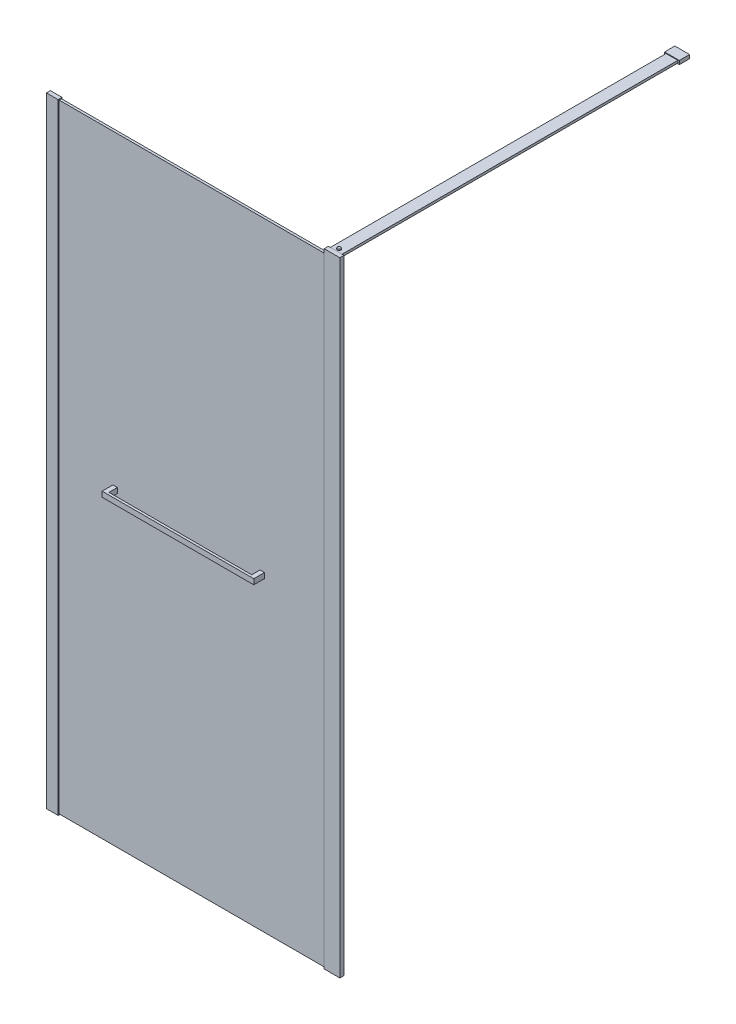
from build123d import *

# Parameters (mm, degrees)
DODANIE_WYCI_GNI_CIE1_START         = 3
DODANIE_WYCI_GNI_CIE1_DEPTH         = 2100
SZKIC2_W                            = 947
SZKIC2_H                            = 8
DODANIE_WYCI_GNI_CIE2_DEPTH         = 2100
DODANIE_WYCI_GNI_CIE3_DEPTH         = 2108
SZKIC4_W                            = 40
SZKIC4_H                            = 13.3
DODANIE_WYCI_GNI_CIE4_DEPTH         = 3
SZKIC5_W                            = 53
SZKIC5_H                            = 14
DODANIE_WYCI_GNI_CIE5_DEPTH         = 8
DODANIE_WYCI_GNI_CIE6_START         = -1.3
SZKIC6_W                            = 8.1
SZKIC6_H                            = 7.8
DODANIE_WYCI_GNI_CIE6_DEPTH         = 15
SZKIC7_W                            = 53
SZKIC7_H                            = 14
DODANIE_WYCI_GNI_CIE7_DEPTH         = 3
SZKIC8_W                            = 40
SZKIC8_H                            = 13.3
DODANIE_WYCI_GNI_CIE8_DEPTH         = 3
SZKIC9_W                            = 40
SZKIC9_H                            = 8
DODANIE_WYCI_GNI_CIE9_DEPTH         = 1170
DODANIE_WYCI_GNI_CIE10_START        = -29.4
SZKIC10_W                           = 50
SZKIC10_H                           = 12.5
DODANIE_WYCI_GNI_CIE10_DEPTH        = 35
DODANIE_WYCI_GNI_CIE11_DEPTH        = 36.5
DODANIE_WYCI_GNI_CIE11_DEPTH_BACK   = 18
SZKIC12_W                           = 15
SZKIC12_H                           = 18
DODANIE_WYCI_GNI_CIE11_2_DEPTH      = 36.5
DODANIE_WYCI_GNI_CIE11_2_DEPTH_BACK = 18
SZKIC13_W                           = 8
SZKIC13_H                           = 18
DODANIE_WYCI_GNI_CIE12_DEPTH        = 485


with BuildPart() as part:
    # Szkic1 → Dodanie-wyci_gni_cie1 (new body)
    with BuildSketch(Plane(origin=(0, 0, 0), x_dir=(1, 0, 0), z_dir=(0, 1, 0)).offset(DODANIE_WYCI_GNI_CIE1_START)):
        Polygon((0, 0), (0, 13.3), (40, 13.3), (40, 11.4), (6.5, 11.4), (6.5, 3.4), (40, 3.4), (40, 0), align=None)
    extrude(amount=DODANIE_WYCI_GNI_CIE1_DEPTH)

    # Szkic4 → Dodanie-wyci_gni_cie4 (add)
    with BuildSketch(Plane(origin=(0, 2103, 0), x_dir=(1, 0, 0), z_dir=(0, 1, 0))):
        with Locations((20, 6.65)):
            Rectangle(SZKIC4_W, SZKIC4_H)
    extrude(amount=DODANIE_WYCI_GNI_CIE4_DEPTH)

    # Szkic8 → Dodanie-wyci_gni_cie8 (add)
    with BuildSketch(Plane.XZ.offset(-3)):
        with Locations((20, -6.65)):
            Rectangle(SZKIC8_W, SZKIC8_H)
    extrude(amount=DODANIE_WYCI_GNI_CIE8_DEPTH)


with BuildPart() as body_2:
    # Szkic2 → Dodanie-wyci_gni_cie2 (new body)
    with BuildSketch(Plane.XZ.offset(-3)):
        with Locations((480, -7.4)):
            Rectangle(SZKIC2_W, SZKIC2_H)
    extrude(amount=-DODANIE_WYCI_GNI_CIE2_DEPTH)


with BuildPart() as body_3:
    # Szkic3 → Dodanie-wyci_gni_cie3 (new body)
    with BuildSketch(Plane.XZ.offset(-3)):
        Polygon((943.4, -3.4), (943.4, -0.4), (996.4, -0.4), (996.4, -14.4), (943.4, -14.4), (943.4, -11.4), (953.5, -11.4), (953.5, -3.4), align=None)
    extrude(amount=-DODANIE_WYCI_GNI_CIE3_DEPTH)

    # Szkic5 → Dodanie-wyci_gni_cie5 (add)
    with BuildSketch(Plane(origin=(0, 2111, 0), x_dir=(1, 0, 0), z_dir=(0, 1, 0))):
        with Locations((969.9, 7.4)):
            Rectangle(SZKIC5_W, SZKIC5_H)
    extrude(amount=DODANIE_WYCI_GNI_CIE5_DEPTH)

    # Szkic6 → Dodanie-wyci_gni_cie6 (add)
    with BuildSketch(Plane.ZY.offset(-943.4).offset(DODANIE_WYCI_GNI_CIE6_START)):
        with Locations((-7.4, 2107.1)):
            Rectangle(SZKIC6_W, SZKIC6_H)
    extrude(amount=-DODANIE_WYCI_GNI_CIE6_DEPTH)

    # Szkic7 → Dodanie-wyci_gni_cie7 (add)
    with BuildSketch(Plane.XZ.offset(-3)):
        with Locations((969.9, -7.4)):
            Rectangle(SZKIC7_W, SZKIC7_H)
    extrude(amount=DODANIE_WYCI_GNI_CIE7_DEPTH)


with BuildPart() as body_4:
    # Szkic9 → Dodanie-wyci_gni_cie9 (new body)
    with BuildSketch(Plane(origin=(0, 0, -14.4), x_dir=(-1, 0, 0), z_dir=(0, 0, -1))):
        with Locations((-969.9, 2115)):
            Rectangle(SZKIC9_W, SZKIC9_H)
    extrude(amount=DODANIE_WYCI_GNI_CIE9_DEPTH)

    # Szkic10 → Dodanie-wyci_gni_cie10 (add)
    with BuildSketch(Plane(origin=(0, 0, -1184.4), x_dir=(-1, 0, 0), z_dir=(0, 0, -1)).offset(DODANIE_WYCI_GNI_CIE10_START)):
        with Locations((-969.9, 2115)):
            Rectangle(SZKIC10_W, SZKIC10_H)
    extrude(amount=DODANIE_WYCI_GNI_CIE10_DEPTH)

    # Szkic11 → Obr_t1 (revolve)
    with BuildSketch(Plane(origin=(969.9, 0, 0), x_dir=(0, 0, -1), z_dir=(1, 0, 0))):
        with BuildLine():
            Line((30.3, 2119), (30.05, 2122.8))
            ThreePointArc((30.05, 2122.8), (27.38045718, 2124.212280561), (24.4, 2124.7))
            Line((24.4, 2124.7), (24.4, 2124.2))
            ThreePointArc((24.4, 2124.2), (27.113886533, 2123.773650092), (29.566308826, 2122.535676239))
            Line((29.566308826, 2122.535676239), (29.798919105, 2119))
            Line((29.798919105, 2119), (30.3, 2119))
        make_face()
    revolve(axis=Axis((969.9, 2119, -24.4), (0, 1, 0)))


with BuildPart() as body_5:
    # Szkic12 → Dodanie-wyci_gni_cie11 (new, two sides: drawn at the far end of the back side and taken through both)
    with BuildSketch(Plane.XY.offset(-3.4).offset(-DODANIE_WYCI_GNI_CIE11_DEPTH_BACK)):
        with Locations((230, 1053)):
            Rectangle(SZKIC12_W, SZKIC12_H)
    extrude(amount=DODANIE_WYCI_GNI_CIE11_DEPTH + DODANIE_WYCI_GNI_CIE11_DEPTH_BACK)



with BuildPart() as body_6:
    # Szkic12 → Dodanie-wyci_gni_cie11 2 (new, two sides: drawn at the far end of the back side and taken through both)
    with BuildSketch(Plane.XY.offset(-3.4).offset(-DODANIE_WYCI_GNI_CIE11_2_DEPTH_BACK)):
        with Locations((730, 1053)):
            Rectangle(SZKIC12_W, SZKIC12_H)
    extrude(amount=DODANIE_WYCI_GNI_CIE11_2_DEPTH + DODANIE_WYCI_GNI_CIE11_2_DEPTH_BACK)


with BuildPart() as body_5_1:
    add(body_5.part)

    add(body_6.part)  # Dodanie-wyci_gni_cie12 merges body 6
    # Szkic13 → Dodanie-wyci_gni_cie12 (add)
    with BuildSketch(Plane(origin=(237.5, 0, 0), x_dir=(0, 0, -1), z_dir=(1, 0, 0))):
        with Locations((-29.1, 1053)):
            Rectangle(SZKIC13_W, SZKIC13_H)
    extrude(amount=DODANIE_WYCI_GNI_CIE12_DEPTH)


solid = Compound([part.part, body_2.part, body_3.part, body_4.part, body_5_1.part])
